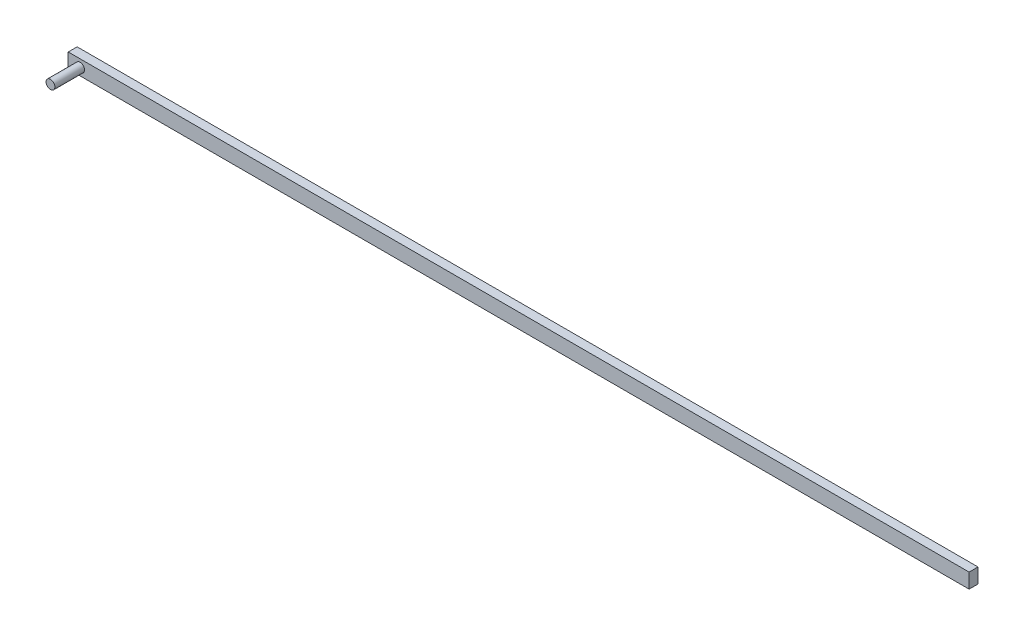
ISO-10303-21;
HEADER;
FILE_DESCRIPTION(('STEP AP214'),'2;1');
FILE_NAME('part.step','',(''),(''),'','','');
FILE_SCHEMA(('AUTOMOTIVE_DESIGN { 1 0 10303 214 1 1 1 1 }'));
ENDSEC;
DATA;
#1=APPLICATION_CONTEXT('core data for automotive mechanical design processes');
#2=APPLICATION_PROTOCOL_DEFINITION('international standard','automotive_design',2000,#1);
#3=PRODUCT_CONTEXT('',#1,'mechanical');
#4=PRODUCT('Part','Part','',(#3));
#5=PRODUCT_RELATED_PRODUCT_CATEGORY('part','',(#4));
#6=PRODUCT_DEFINITION_FORMATION('','',#4);
#7=PRODUCT_DEFINITION_CONTEXT('part definition',#1,'design');
#8=PRODUCT_DEFINITION('design','',#6,#7);
#9=PRODUCT_DEFINITION_SHAPE('','',#8);
#10=(LENGTH_UNIT() NAMED_UNIT(*) SI_UNIT(.MILLI.,.METRE.));
#11=(NAMED_UNIT(*) PLANE_ANGLE_UNIT() SI_UNIT($,.RADIAN.));
#12=(NAMED_UNIT(*) SI_UNIT($,.STERADIAN.) SOLID_ANGLE_UNIT());
#13=UNCERTAINTY_MEASURE_WITH_UNIT(LENGTH_MEASURE(1.E-05),#10,'distance_accuracy_value','');
#14=(GEOMETRIC_REPRESENTATION_CONTEXT(3) GLOBAL_UNCERTAINTY_ASSIGNED_CONTEXT((#13)) GLOBAL_UNIT_ASSIGNED_CONTEXT((#10,
#11,#12)) REPRESENTATION_CONTEXT('',''));
#15=CARTESIAN_POINT('',(0.,0.,0.));
#16=DIRECTION('',(0.,0.,1.));
#17=DIRECTION('',(1.,0.,0.));
#18=AXIS2_PLACEMENT_3D('',#15,#16,#17);
#19=CARTESIAN_POINT('',(0.,0.,30.));
#20=DIRECTION('',(0.,0.,-1.));
#21=DIRECTION('',(-1.,0.,0.));
#22=AXIS2_PLACEMENT_3D('',#19,#20,#21);
#23=PLANE('',#22);
#24=DIRECTION('',(0.,-1.,0.));
#25=VECTOR('',#24,1.);
#26=CARTESIAN_POINT('',(0.,0.,30.));
#27=LINE('',#26,#25);
#28=CARTESIAN_POINT('',(-1.77635683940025E-12,50.,30.));
#29=VERTEX_POINT('',#28);
#30=CARTESIAN_POINT('',(0.,0.,30.));
#31=VERTEX_POINT('',#30);
#32=EDGE_CURVE('E88',#29,#31,#27,.T.);
#33=ORIENTED_EDGE('',*,*,#32,.T.);
#34=DIRECTION('',(1.,0.,0.));
#35=VECTOR('',#34,1.);
#36=CARTESIAN_POINT('',(0.,0.,30.));
#37=LINE('',#36,#35);
#38=CARTESIAN_POINT('',(3040.,0.,30.));
#39=VERTEX_POINT('',#38);
#40=EDGE_CURVE('E83',#31,#39,#37,.T.);
#41=ORIENTED_EDGE('',*,*,#40,.T.);
#42=DIRECTION('',(0.,1.,0.));
#43=VECTOR('',#42,1.);
#44=CARTESIAN_POINT('',(3040.,0.,30.));
#45=LINE('',#44,#43);
#46=CARTESIAN_POINT('',(3040.,50.,30.));
#47=VERTEX_POINT('',#46);
#48=EDGE_CURVE('E86',#39,#47,#45,.T.);
#49=ORIENTED_EDGE('',*,*,#48,.T.);
#50=DIRECTION('',(-1.,0.,0.));
#51=VECTOR('',#50,1.);
#52=CARTESIAN_POINT('',(-1.77635683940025E-12,50.,30.));
#53=LINE('',#52,#51);
#54=EDGE_CURVE('E52',#47,#29,#53,.T.);
#55=ORIENTED_EDGE('',*,*,#54,.T.);
#56=EDGE_LOOP('',(#33,#41,#49,#55));
#57=FACE_BOUND('',#56,.T.);
#58=CARTESIAN_POINT('',(39.9999999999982,25.,30.));
#59=DIRECTION('',(0.,0.,-1.));
#60=DIRECTION('',(-1.,0.,0.));
#61=AXIS2_PLACEMENT_3D('',#58,#59,#60);
#62=CIRCLE('',#61,15.);
#63=CARTESIAN_POINT('',(24.9999999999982,25.,30.));
#64=VERTEX_POINT('',#63);
#65=EDGE_CURVE('E11',#64,#64,#62,.F.);
#66=ORIENTED_EDGE('',*,*,#65,.F.);
#67=EDGE_LOOP('',(#66));
#68=FACE_BOUND('',#67,.T.);
#69=ADVANCED_FACE('F35',(#57,#68),#23,.F.);
#70=CARTESIAN_POINT('',(0.,0.,30.));
#71=DIRECTION('',(1.,0.,0.));
#72=DIRECTION('',(0.,1.,0.));
#73=AXIS2_PLACEMENT_3D('',#70,#71,#72);
#74=PLANE('',#73);
#75=DIRECTION('',(0.,-1.,0.));
#76=VECTOR('',#75,1.);
#77=CARTESIAN_POINT('',(0.,0.,0.));
#78=LINE('',#77,#76);
#79=CARTESIAN_POINT('',(-1.77635683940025E-12,50.,0.));
#80=VERTEX_POINT('',#79);
#81=CARTESIAN_POINT('',(0.,0.,0.));
#82=VERTEX_POINT('',#81);
#83=EDGE_CURVE('E102',#80,#82,#78,.T.);
#84=ORIENTED_EDGE('',*,*,#83,.T.);
#85=DIRECTION('',(0.,0.,-1.));
#86=VECTOR('',#85,1.);
#87=CARTESIAN_POINT('',(0.,0.,30.));
#88=LINE('',#87,#86);
#89=EDGE_CURVE('E44',#31,#82,#88,.T.);
#90=ORIENTED_EDGE('',*,*,#89,.F.);
#91=ORIENTED_EDGE('',*,*,#32,.F.);
#92=DIRECTION('',(0.,0.,-1.));
#93=VECTOR('',#92,1.);
#94=CARTESIAN_POINT('',(-1.77635683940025E-12,50.,30.));
#95=LINE('',#94,#93);
#96=EDGE_CURVE('E98',#29,#80,#95,.T.);
#97=ORIENTED_EDGE('',*,*,#96,.T.);
#98=EDGE_LOOP('',(#84,#90,#91,#97));
#99=FACE_BOUND('',#98,.T.);
#100=ADVANCED_FACE('F37',(#99),#74,.F.);
#101=CARTESIAN_POINT('',(0.,0.,30.));
#102=DIRECTION('',(0.,1.,0.));
#103=DIRECTION('',(0.,0.,1.));
#104=AXIS2_PLACEMENT_3D('',#101,#102,#103);
#105=PLANE('',#104);
#106=DIRECTION('',(1.,0.,0.));
#107=VECTOR('',#106,1.);
#108=CARTESIAN_POINT('',(0.,0.,0.));
#109=LINE('',#108,#107);
#110=CARTESIAN_POINT('',(3040.,0.,0.));
#111=VERTEX_POINT('',#110);
#112=EDGE_CURVE('E93',#82,#111,#109,.T.);
#113=ORIENTED_EDGE('',*,*,#112,.T.);
#114=DIRECTION('',(0.,0.,-1.));
#115=VECTOR('',#114,1.);
#116=CARTESIAN_POINT('',(3040.,0.,30.));
#117=LINE('',#116,#115);
#118=EDGE_CURVE('E91',#39,#111,#117,.T.);
#119=ORIENTED_EDGE('',*,*,#118,.F.);
#120=ORIENTED_EDGE('',*,*,#40,.F.);
#121=ORIENTED_EDGE('',*,*,#89,.T.);
#122=EDGE_LOOP('',(#113,#119,#120,#121));
#123=FACE_BOUND('',#122,.T.);
#124=ADVANCED_FACE('F92',(#123),#105,.F.);
#125=CARTESIAN_POINT('',(3040.,0.,30.));
#126=DIRECTION('',(-1.,0.,0.));
#127=DIRECTION('',(0.,0.,1.));
#128=AXIS2_PLACEMENT_3D('',#125,#126,#127);
#129=PLANE('',#128);
#130=DIRECTION('',(0.,1.,0.));
#131=VECTOR('',#130,1.);
#132=CARTESIAN_POINT('',(3040.,0.,0.));
#133=LINE('',#132,#131);
#134=CARTESIAN_POINT('',(3040.,50.,0.));
#135=VERTEX_POINT('',#134);
#136=EDGE_CURVE('E69',#111,#135,#133,.T.);
#137=ORIENTED_EDGE('',*,*,#136,.T.);
#138=DIRECTION('',(0.,0.,-1.));
#139=VECTOR('',#138,1.);
#140=CARTESIAN_POINT('',(3040.,50.,30.));
#141=LINE('',#140,#139);
#142=EDGE_CURVE('E94',#47,#135,#141,.T.);
#143=ORIENTED_EDGE('',*,*,#142,.F.);
#144=ORIENTED_EDGE('',*,*,#48,.F.);
#145=ORIENTED_EDGE('',*,*,#118,.T.);
#146=EDGE_LOOP('',(#137,#143,#144,#145));
#147=FACE_BOUND('',#146,.T.);
#148=ADVANCED_FACE('F96',(#147),#129,.F.);
#149=CARTESIAN_POINT('',(-1.77635683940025E-12,50.,30.));
#150=DIRECTION('',(0.,-1.,0.));
#151=DIRECTION('',(1.,0.,0.));
#152=AXIS2_PLACEMENT_3D('',#149,#150,#151);
#153=PLANE('',#152);
#154=DIRECTION('',(-1.,0.,0.));
#155=VECTOR('',#154,1.);
#156=CARTESIAN_POINT('',(-1.77635683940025E-12,50.,0.));
#157=LINE('',#156,#155);
#158=EDGE_CURVE('E75',#135,#80,#157,.T.);
#159=ORIENTED_EDGE('',*,*,#158,.T.);
#160=ORIENTED_EDGE('',*,*,#96,.F.);
#161=ORIENTED_EDGE('',*,*,#54,.F.);
#162=ORIENTED_EDGE('',*,*,#142,.T.);
#163=EDGE_LOOP('',(#159,#160,#161,#162));
#164=FACE_BOUND('',#163,.T.);
#165=ADVANCED_FACE('F116',(#164),#153,.F.);
#166=CARTESIAN_POINT('',(0.,0.,0.));
#167=DIRECTION('',(0.,0.,-1.));
#168=DIRECTION('',(-1.,0.,0.));
#169=AXIS2_PLACEMENT_3D('',#166,#167,#168);
#170=PLANE('',#169);
#171=ORIENTED_EDGE('',*,*,#83,.F.);
#172=ORIENTED_EDGE('',*,*,#158,.F.);
#173=ORIENTED_EDGE('',*,*,#136,.F.);
#174=ORIENTED_EDGE('',*,*,#112,.F.);
#175=EDGE_LOOP('',(#171,#172,#173,#174));
#176=FACE_BOUND('',#175,.T.);
#177=ADVANCED_FACE('F113',(#176),#170,.T.);
#178=CARTESIAN_POINT('',(39.9999999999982,25.,130.));
#179=DIRECTION('',(0.,0.,-1.));
#180=DIRECTION('',(-1.,0.,0.));
#181=AXIS2_PLACEMENT_3D('',#178,#179,#180);
#182=CYLINDRICAL_SURFACE('',#181,15.);
#183=CARTESIAN_POINT('',(39.9999999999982,25.,130.));
#184=DIRECTION('',(0.,0.,1.));
#185=DIRECTION('',(1.,0.,0.));
#186=AXIS2_PLACEMENT_3D('',#183,#184,#185);
#187=CIRCLE('',#186,15.);
#188=CARTESIAN_POINT('',(54.9999999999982,25.,130.));
#189=VERTEX_POINT('',#188);
#190=EDGE_CURVE('E105',#189,#189,#187,.T.);
#191=ORIENTED_EDGE('',*,*,#190,.F.);
#192=EDGE_LOOP('',(#191));
#193=FACE_BOUND('',#192,.T.);
#194=ORIENTED_EDGE('',*,*,#65,.T.);
#195=EDGE_LOOP('',(#194));
#196=FACE_BOUND('',#195,.T.);
#197=ADVANCED_FACE('F115',(#193,#196),#182,.T.);
#198=CARTESIAN_POINT('',(39.9999999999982,25.,130.));
#199=DIRECTION('',(0.,0.,1.));
#200=DIRECTION('',(1.,0.,0.));
#201=AXIS2_PLACEMENT_3D('',#198,#199,#200);
#202=PLANE('',#201);
#203=ORIENTED_EDGE('',*,*,#190,.T.);
#204=EDGE_LOOP('',(#203));
#205=FACE_BOUND('',#204,.T.);
#206=ADVANCED_FACE('F122',(#205),#202,.T.);
#207=CLOSED_SHELL('',(#69,#100,#124,#148,#165,#177,#197,#206));
#208=MANIFOLD_SOLID_BREP('B2',#207);
#209=ADVANCED_BREP_SHAPE_REPRESENTATION('',(#18,#208),#14);
#210=SHAPE_DEFINITION_REPRESENTATION(#9,#209);
ENDSEC;
END-ISO-10303-21;
